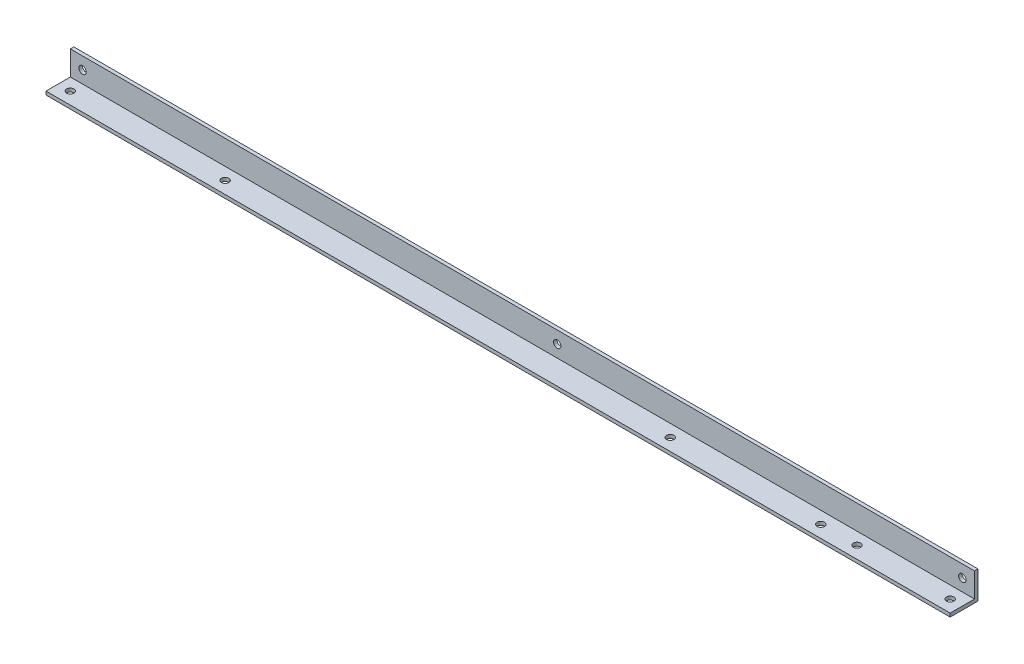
from build123d import *

# Parameters (mm, degrees)
SKETCH1_W           = 825.5
SKETCH1_H           = 25.4
BOSS_EXTRUDE1_DEPTH = 3.175
SKETCH2_W           = 825.5
SKETCH2_H           = 3.175
BOSS_EXTRUDE2_DEPTH = 22.225
SKETCH3_R           = 3.3782
CUT_EXTRUDE1_DEPTH  = 414.542988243
SKETCH4_R           = 3.3782
CUT_EXTRUDE2_DEPTH  = 415.127604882


with BuildPart() as part:
    # Sketch1 → Boss-Extrude1 (new body)
    with BuildSketch(Plane(origin=(0, 0, 0), x_dir=(1, 0, 0), z_dir=(0, 1, 0))):
        Rectangle(SKETCH1_W, SKETCH1_H)
    extrude(amount=BOSS_EXTRUDE1_DEPTH)

    # Sketch2 → Boss-Extrude2 (add)
    with BuildSketch(Plane(origin=(0, 3.175, 0), x_dir=(1, 0, 0), z_dir=(0, 1, 0))):
        with Locations((0, 11.1125)):
            Rectangle(SKETCH2_W, SKETCH2_H)
    extrude(amount=BOSS_EXTRUDE2_DEPTH)

    # Sketch3 → Cut-Extrude1 (cut, through all)
    with BuildSketch(Plane(origin=(0, 3.175, 0), x_dir=(1, 0, 0), z_dir=(0, 1, 0))):
        with Locations(Location((-401.6375, -1.5875, 0), (0, 0, 270))):
            Circle(SKETCH3_R)
        with Locations(Location((-260.35, -1.5875, 0), (0, 0, 270))):
            Circle(SKETCH3_R)
        with Locations(Location((401.6375, -1.5875, 0), (0, 0, 270))):
            Circle(SKETCH3_R)
        with Locations(Location((316.5475, -1.5875, 0), (0, 0, 270))):
            Circle(SKETCH3_R)
        with Locations(Location((146.05, -1.5875, 0), (0, 0, 270))):
            Circle(SKETCH3_R)
        with Locations(Location((283.5275, -1.5875, 0), (0, 0, 270))):
            Circle(SKETCH3_R)
    extrude(amount=-CUT_EXTRUDE1_DEPTH, mode=Mode.SUBTRACT)

    # Sketch4 → Cut-Extrude2 (cut, through all)
    with BuildSketch(Plane.XY.offset(-9.525)):
        with Locations((-401.6375, 14.2875)):
            Circle(SKETCH4_R)
        with Locations((401.6375, 14.2875)):
            Circle(SKETCH4_R)
        with Locations((31.75, 14.2875)):
            Circle(SKETCH4_R)
    extrude(amount=-CUT_EXTRUDE2_DEPTH, mode=Mode.SUBTRACT)


solid = part.part
